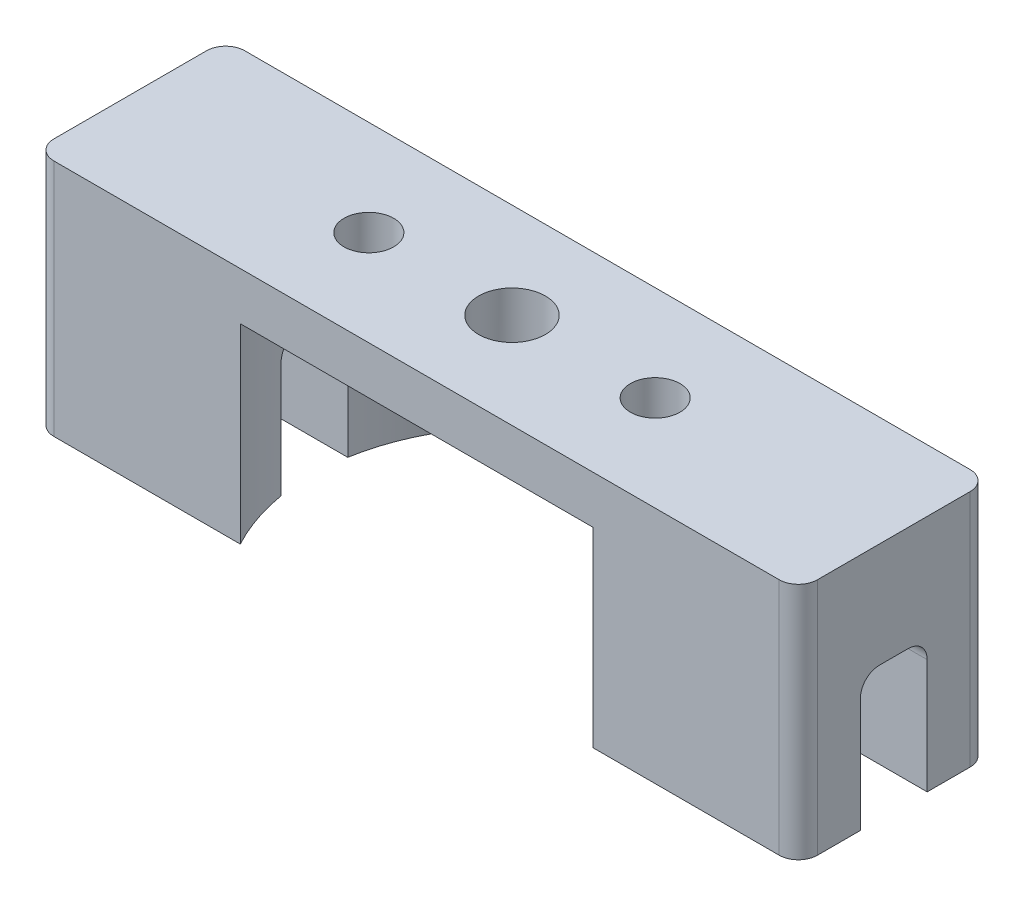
ISO-10303-21;
HEADER;
FILE_DESCRIPTION(('STEP AP214'),'2;1');
FILE_NAME('part.step','',(''),(''),'','','');
FILE_SCHEMA(('AUTOMOTIVE_DESIGN { 1 0 10303 214 1 1 1 1 }'));
ENDSEC;
DATA;
#1=APPLICATION_CONTEXT('core data for automotive mechanical design processes');
#2=APPLICATION_PROTOCOL_DEFINITION('international standard','automotive_design',2000,#1);
#3=PRODUCT_CONTEXT('',#1,'mechanical');
#4=PRODUCT('Part','Part','',(#3));
#5=PRODUCT_RELATED_PRODUCT_CATEGORY('part','',(#4));
#6=PRODUCT_DEFINITION_FORMATION('','',#4);
#7=PRODUCT_DEFINITION_CONTEXT('part definition',#1,'design');
#8=PRODUCT_DEFINITION('design','',#6,#7);
#9=PRODUCT_DEFINITION_SHAPE('','',#8);
#10=(LENGTH_UNIT() NAMED_UNIT(*) SI_UNIT(.MILLI.,.METRE.));
#11=(NAMED_UNIT(*) PLANE_ANGLE_UNIT() SI_UNIT($,.RADIAN.));
#12=(NAMED_UNIT(*) SI_UNIT($,.STERADIAN.) SOLID_ANGLE_UNIT());
#13=UNCERTAINTY_MEASURE_WITH_UNIT(LENGTH_MEASURE(1.E-05),#10,'distance_accuracy_value','');
#14=(GEOMETRIC_REPRESENTATION_CONTEXT(3) GLOBAL_UNCERTAINTY_ASSIGNED_CONTEXT((#13)) GLOBAL_UNIT_ASSIGNED_CONTEXT((#10,
#11,#12)) REPRESENTATION_CONTEXT('',''));
#15=CARTESIAN_POINT('',(0.,0.,0.));
#16=DIRECTION('',(0.,0.,1.));
#17=DIRECTION('',(1.,0.,0.));
#18=AXIS2_PLACEMENT_3D('',#15,#16,#17);
#19=CARTESIAN_POINT('',(0.,0.,0.));
#20=DIRECTION('',(0.,-1.,0.));
#21=DIRECTION('',(0.,0.,-1.));
#22=AXIS2_PLACEMENT_3D('',#19,#20,#21);
#23=PLANE('',#22);
#24=DIRECTION('',(0.,0.,-1.));
#25=VECTOR('',#24,1.);
#26=CARTESIAN_POINT('',(101.6,0.,0.));
#27=LINE('',#26,#25);
#28=CARTESIAN_POINT('',(101.6,0.,-2.54));
#29=VERTEX_POINT('',#28);
#30=CARTESIAN_POINT('',(101.6,0.,-8.255));
#31=VERTEX_POINT('',#30);
#32=EDGE_CURVE('E287',#29,#31,#27,.T.);
#33=ORIENTED_EDGE('',*,*,#32,.F.);
#34=CARTESIAN_POINT('',(99.06,0.,-2.54));
#35=DIRECTION('',(0.,-1.,0.));
#36=DIRECTION('',(0.,0.,-1.));
#37=AXIS2_PLACEMENT_3D('',#34,#35,#36);
#38=CIRCLE('',#37,2.54);
#39=CARTESIAN_POINT('',(99.06,0.,0.));
#40=VERTEX_POINT('',#39);
#41=EDGE_CURVE('E403',#29,#40,#38,.T.);
#42=ORIENTED_EDGE('',*,*,#41,.T.);
#43=DIRECTION('',(1.,0.,0.));
#44=VECTOR('',#43,1.);
#45=CARTESIAN_POINT('',(0.,0.,0.));
#46=LINE('',#45,#44);
#47=CARTESIAN_POINT('',(74.2520553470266,0.,0.));
#48=VERTEX_POINT('',#47);
#49=EDGE_CURVE('E283',#48,#40,#46,.T.);
#50=ORIENTED_EDGE('',*,*,#49,.F.);
#51=CARTESIAN_POINT('',(50.8,0.,-12.7));
#52=DIRECTION('',(0.,-1.,0.));
#53=DIRECTION('',(0.,0.,-1.));
#54=AXIS2_PLACEMENT_3D('',#51,#52,#53);
#55=CIRCLE('',#54,26.67);
#56=CARTESIAN_POINT('',(77.0969746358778,0.,-8.255));
#57=VERTEX_POINT('',#56);
#58=EDGE_CURVE('E381',#57,#48,#55,.T.);
#59=ORIENTED_EDGE('',*,*,#58,.F.);
#60=DIRECTION('',(1.,0.,0.));
#61=VECTOR('',#60,1.);
#62=CARTESIAN_POINT('',(0.,0.,-8.255));
#63=LINE('',#62,#61);
#64=EDGE_CURVE('E264',#57,#31,#63,.T.);
#65=ORIENTED_EDGE('',*,*,#64,.T.);
#66=EDGE_LOOP('',(#33,#42,#50,#59,#65));
#67=FACE_BOUND('',#66,.T.);
#68=ADVANCED_FACE('F38',(#67),#23,.T.);
#69=DIRECTION('',(-1.,0.,0.));
#70=VECTOR('',#69,1.);
#71=CARTESIAN_POINT('',(0.,0.,-25.4));
#72=LINE('',#71,#70);
#73=CARTESIAN_POINT('',(99.06,0.,-25.4));
#74=VERTEX_POINT('',#73);
#75=CARTESIAN_POINT('',(74.2520553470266,0.,-25.4));
#76=VERTEX_POINT('',#75);
#77=EDGE_CURVE('E225',#74,#76,#72,.T.);
#78=ORIENTED_EDGE('',*,*,#77,.F.);
#79=CARTESIAN_POINT('',(99.06,0.,-22.86));
#80=DIRECTION('',(0.,-1.,0.));
#81=DIRECTION('',(0.,0.,-1.));
#82=AXIS2_PLACEMENT_3D('',#79,#80,#81);
#83=CIRCLE('',#82,2.54);
#84=CARTESIAN_POINT('',(101.6,0.,-22.86));
#85=VERTEX_POINT('',#84);
#86=EDGE_CURVE('E435',#74,#85,#83,.T.);
#87=ORIENTED_EDGE('',*,*,#86,.T.);
#88=CARTESIAN_POINT('',(101.6,0.,-17.145));
#89=VERTEX_POINT('',#88);
#90=EDGE_CURVE('E286',#89,#85,#27,.T.);
#91=ORIENTED_EDGE('',*,*,#90,.F.);
#92=DIRECTION('',(1.,0.,0.));
#93=VECTOR('',#92,1.);
#94=CARTESIAN_POINT('',(0.,0.,-17.145));
#95=LINE('',#94,#93);
#96=CARTESIAN_POINT('',(77.0969746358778,0.,-17.145));
#97=VERTEX_POINT('',#96);
#98=EDGE_CURVE('E252',#97,#89,#95,.T.);
#99=ORIENTED_EDGE('',*,*,#98,.F.);
#100=EDGE_CURVE('E391',#76,#97,#55,.T.);
#101=ORIENTED_EDGE('',*,*,#100,.F.);
#102=EDGE_LOOP('',(#78,#87,#91,#99,#101));
#103=FACE_BOUND('',#102,.T.);
#104=ADVANCED_FACE('F458',(#103),#23,.T.);
#105=CARTESIAN_POINT('',(0.,0.,-8.255));
#106=DIRECTION('',(0.,0.,-1.));
#107=DIRECTION('',(0.,1.,0.));
#108=AXIS2_PLACEMENT_3D('',#105,#106,#107);
#109=PLANE('',#108);
#110=DIRECTION('',(0.,-1.,0.));
#111=VECTOR('',#110,1.);
#112=CARTESIAN_POINT('',(77.0969746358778,25.4,-8.255));
#113=LINE('',#112,#111);
#114=CARTESIAN_POINT('',(77.0969746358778,15.24,-8.255));
#115=VERTEX_POINT('',#114);
#116=EDGE_CURVE('E352',#115,#57,#113,.T.);
#117=ORIENTED_EDGE('',*,*,#116,.F.);
#118=DIRECTION('',(1.,0.,0.));
#119=VECTOR('',#118,1.);
#120=CARTESIAN_POINT('',(101.6,15.24,-8.255));
#121=LINE('',#120,#119);
#122=CARTESIAN_POINT('',(101.6,15.24,-8.255));
#123=VERTEX_POINT('',#122);
#124=EDGE_CURVE('E302',#115,#123,#121,.T.);
#125=ORIENTED_EDGE('',*,*,#124,.T.);
#126=DIRECTION('',(0.,1.,0.));
#127=VECTOR('',#126,1.);
#128=CARTESIAN_POINT('',(101.6,0.,-8.255));
#129=LINE('',#128,#127);
#130=EDGE_CURVE('E246',#31,#123,#129,.T.);
#131=ORIENTED_EDGE('',*,*,#130,.F.);
#132=ORIENTED_EDGE('',*,*,#64,.F.);
#133=EDGE_LOOP('',(#117,#125,#131,#132));
#134=FACE_BOUND('',#133,.T.);
#135=ADVANCED_FACE('F393',(#134),#109,.T.);
#136=CARTESIAN_POINT('',(0.,17.78,0.));
#137=DIRECTION('',(0.,-1.,0.));
#138=DIRECTION('',(0.,0.,-1.));
#139=AXIS2_PLACEMENT_3D('',#136,#137,#138);
#140=PLANE('',#139);
#141=CARTESIAN_POINT('',(50.8,17.78,-12.7));
#142=DIRECTION('',(0.,-1.,0.));
#143=DIRECTION('',(0.,0.,-1.));
#144=AXIS2_PLACEMENT_3D('',#141,#142,#143);
#145=CIRCLE('',#144,26.67);
#146=CARTESIAN_POINT('',(77.4018772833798,17.78,-14.605));
#147=VERTEX_POINT('',#146);
#148=CARTESIAN_POINT('',(77.4018772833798,17.78,-10.795));
#149=VERTEX_POINT('',#148);
#150=EDGE_CURVE('E219',#147,#149,#145,.T.);
#151=ORIENTED_EDGE('',*,*,#150,.F.);
#152=DIRECTION('',(1.,0.,0.));
#153=VECTOR('',#152,1.);
#154=CARTESIAN_POINT('',(0.,17.78,-14.605));
#155=LINE('',#154,#153);
#156=CARTESIAN_POINT('',(101.6,17.78,-14.605));
#157=VERTEX_POINT('',#156);
#158=EDGE_CURVE('E294',#147,#157,#155,.T.);
#159=ORIENTED_EDGE('',*,*,#158,.T.);
#160=DIRECTION('',(0.,0.,-1.));
#161=VECTOR('',#160,1.);
#162=CARTESIAN_POINT('',(101.6,17.78,0.));
#163=LINE('',#162,#161);
#164=CARTESIAN_POINT('',(101.6,17.78,-10.795));
#165=VERTEX_POINT('',#164);
#166=EDGE_CURVE('E255',#165,#157,#163,.T.);
#167=ORIENTED_EDGE('',*,*,#166,.F.);
#168=DIRECTION('',(1.,0.,0.));
#169=VECTOR('',#168,1.);
#170=CARTESIAN_POINT('',(0.,17.78,-10.795));
#171=LINE('',#170,#169);
#172=EDGE_CURVE('E291',#165,#149,#171,.F.);
#173=ORIENTED_EDGE('',*,*,#172,.T.);
#174=EDGE_LOOP('',(#151,#159,#167,#173));
#175=FACE_BOUND('',#174,.T.);
#176=ADVANCED_FACE('F468',(#175),#140,.T.);
#177=CARTESIAN_POINT('',(0.,0.,-17.145));
#178=DIRECTION('',(0.,0.,-1.));
#179=DIRECTION('',(0.,1.,0.));
#180=AXIS2_PLACEMENT_3D('',#177,#178,#179);
#181=PLANE('',#180);
#182=DIRECTION('',(1.,0.,0.));
#183=VECTOR('',#182,1.);
#184=CARTESIAN_POINT('',(0.,15.24,-17.145));
#185=LINE('',#184,#183);
#186=CARTESIAN_POINT('',(101.6,15.24,-17.145));
#187=VERTEX_POINT('',#186);
#188=CARTESIAN_POINT('',(77.0969746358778,15.24,-17.145));
#189=VERTEX_POINT('',#188);
#190=EDGE_CURVE('E299',#187,#189,#185,.F.);
#191=ORIENTED_EDGE('',*,*,#190,.T.);
#192=DIRECTION('',(0.,-1.,0.));
#193=VECTOR('',#192,1.);
#194=CARTESIAN_POINT('',(77.0969746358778,25.4,-17.145));
#195=LINE('',#194,#193);
#196=EDGE_CURVE('E351',#189,#97,#195,.T.);
#197=ORIENTED_EDGE('',*,*,#196,.T.);
#198=ORIENTED_EDGE('',*,*,#98,.T.);
#199=DIRECTION('',(0.,1.,0.));
#200=VECTOR('',#199,1.);
#201=CARTESIAN_POINT('',(101.6,0.,-17.145));
#202=LINE('',#201,#200);
#203=EDGE_CURVE('E241',#89,#187,#202,.T.);
#204=ORIENTED_EDGE('',*,*,#203,.T.);
#205=EDGE_LOOP('',(#191,#197,#198,#204));
#206=FACE_BOUND('',#205,.T.);
#207=ADVANCED_FACE('F464',(#206),#181,.F.);
#208=CARTESIAN_POINT('',(0.,15.24,-14.605));
#209=DIRECTION('',(1.,0.,0.));
#210=DIRECTION('',(0.,0.,-1.));
#211=AXIS2_PLACEMENT_3D('',#208,#209,#210);
#212=CYLINDRICAL_SURFACE('',#211,2.54);
#213=ORIENTED_EDGE('',*,*,#158,.F.);
#214=CARTESIAN_POINT('',(77.4018772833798,17.78,-14.605));
#215=CARTESIAN_POINT('',(77.3967444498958,17.7800068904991,-14.6767156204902));
#216=CARTESIAN_POINT('',(77.3913163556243,17.7769627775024,-14.7484057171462));
#217=CARTESIAN_POINT('',(77.3799271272,17.7648370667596,-14.8912247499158));
#218=CARTESIAN_POINT('',(77.3739660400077,17.7557560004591,-14.9623537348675));
#219=CARTESIAN_POINT('',(77.3615733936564,17.7316325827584,-15.1034847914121));
#220=CARTESIAN_POINT('',(77.3551422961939,17.7165960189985,-15.1734878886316));
#221=CARTESIAN_POINT('',(77.3418838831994,17.6806923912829,-15.3119236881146));
#222=CARTESIAN_POINT('',(77.3350565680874,17.6598253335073,-15.3803563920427));
#223=CARTESIAN_POINT('',(77.314103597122,17.5886683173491,-15.5826207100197));
#224=CARTESIAN_POINT('',(77.2994993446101,17.5298078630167,-15.7135036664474));
#225=CARTESIAN_POINT('',(77.2698881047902,17.3909980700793,-15.9634058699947));
#226=CARTESIAN_POINT('',(77.2548811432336,17.3110500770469,-16.0824258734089));
#227=CARTESIAN_POINT('',(77.2253534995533,17.1318765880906,-16.3058775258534));
#228=CARTESIAN_POINT('',(77.2108351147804,17.0325718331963,-16.4102460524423));
#229=CARTESIAN_POINT('',(77.1833610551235,16.817626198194,-16.6008281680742));
#230=CARTESIAN_POINT('',(77.1704056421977,16.7019825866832,-16.6870387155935));
#231=CARTESIAN_POINT('',(77.1470521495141,16.4579552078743,-16.838553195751));
#232=CARTESIAN_POINT('',(77.136646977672,16.3296081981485,-16.9039152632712));
#233=CARTESIAN_POINT('',(77.1191580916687,16.0635619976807,-17.0120575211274));
#234=CARTESIAN_POINT('',(77.1120719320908,15.9258697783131,-17.0548543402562));
#235=CARTESIAN_POINT('',(77.1036431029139,15.6960330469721,-17.1054118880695));
#236=CARTESIAN_POINT('',(77.1011501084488,15.6054246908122,-17.1202459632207));
#237=CARTESIAN_POINT('',(77.0978131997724,15.4232249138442,-17.1400395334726));
#238=CARTESIAN_POINT('',(77.0969671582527,15.331634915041,-17.1450117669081));
#239=CARTESIAN_POINT('',(77.0969746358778,15.24,-17.145));
#240=B_SPLINE_CURVE_WITH_KNOTS('',3,(#214,#215,#216,#217,#218,#219,#220,#221,#222,#223,#224,
#225,#226,#227,#228,#229,#230,#231,#232,#233,#234,#235,#236,#237,#238,#239),.UNSPECIFIED.,.F.,
.F.,(4,2,2,2,2,2,2,2,2,2,2,2,4),(0.,0.215624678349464,0.431230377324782,0.646627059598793,
0.862023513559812,1.29255953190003,1.72306808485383,2.15537791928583,2.58776010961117,
3.01892586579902,3.44977344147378,3.72480802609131,3.99948712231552),.UNSPECIFIED.);
#241=EDGE_CURVE('E343',#147,#189,#240,.T.);
#242=ORIENTED_EDGE('',*,*,#241,.T.);
#243=ORIENTED_EDGE('',*,*,#190,.F.);
#244=CARTESIAN_POINT('',(101.6,15.24,-14.605));
#245=DIRECTION('',(-1.,0.,0.));
#246=DIRECTION('',(0.,0.,1.));
#247=AXIS2_PLACEMENT_3D('',#244,#245,#246);
#248=CIRCLE('',#247,2.54);
#249=EDGE_CURVE('E306',#157,#187,#248,.T.);
#250=ORIENTED_EDGE('',*,*,#249,.F.);
#251=EDGE_LOOP('',(#213,#242,#243,#250));
#252=FACE_BOUND('',#251,.T.);
#253=ADVANCED_FACE('F361',(#252),#212,.F.);
#254=CARTESIAN_POINT('',(0.,15.24,-10.795));
#255=DIRECTION('',(-1.,0.,0.));
#256=DIRECTION('',(0.,0.,1.));
#257=AXIS2_PLACEMENT_3D('',#254,#255,#256);
#258=CYLINDRICAL_SURFACE('',#257,2.54);
#259=CARTESIAN_POINT('',(24.1981227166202,17.78,-10.795));
#260=VERTEX_POINT('',#259);
#261=CARTESIAN_POINT('',(0.,17.78,-10.795));
#262=VERTEX_POINT('',#261);
#263=EDGE_CURVE('E280',#260,#262,#171,.F.);
#264=ORIENTED_EDGE('',*,*,#263,.F.);
#265=CARTESIAN_POINT('',(24.1981227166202,17.78,-10.795));
#266=CARTESIAN_POINT('',(24.2032555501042,17.7800068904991,-10.7232843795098));
#267=CARTESIAN_POINT('',(24.2086836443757,17.7769627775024,-10.6515942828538));
#268=CARTESIAN_POINT('',(24.2200728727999,17.7648370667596,-10.5087752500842));
#269=CARTESIAN_POINT('',(24.2260339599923,17.7557560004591,-10.4376462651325));
#270=CARTESIAN_POINT('',(24.2384266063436,17.7316325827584,-10.2965152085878));
#271=CARTESIAN_POINT('',(24.2448577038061,17.7165960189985,-10.2265121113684));
#272=CARTESIAN_POINT('',(24.2581161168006,17.6806923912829,-10.0880763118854));
#273=CARTESIAN_POINT('',(24.2649434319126,17.6598253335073,-10.0196436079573));
#274=CARTESIAN_POINT('',(24.2858964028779,17.588668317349,-9.81737928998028));
#275=CARTESIAN_POINT('',(24.3005006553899,17.5298078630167,-9.6864963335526));
#276=CARTESIAN_POINT('',(24.3301118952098,17.3909980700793,-9.43659413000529));
#277=CARTESIAN_POINT('',(24.3451188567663,17.3110500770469,-9.31757412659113));
#278=CARTESIAN_POINT('',(24.3746465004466,17.1318765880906,-9.09412247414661));
#279=CARTESIAN_POINT('',(24.3891648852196,17.0325718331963,-8.9897539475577));
#280=CARTESIAN_POINT('',(24.4166389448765,16.817626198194,-8.79917183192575));
#281=CARTESIAN_POINT('',(24.4295943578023,16.7019825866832,-8.71296128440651));
#282=CARTESIAN_POINT('',(24.4529478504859,16.4579552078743,-8.56144680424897));
#283=CARTESIAN_POINT('',(24.463353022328,16.3296081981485,-8.49608473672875));
#284=CARTESIAN_POINT('',(24.4808419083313,16.0635619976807,-8.38794247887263));
#285=CARTESIAN_POINT('',(24.4879280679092,15.9258697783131,-8.34514565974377));
#286=CARTESIAN_POINT('',(24.496356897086,15.6960330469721,-8.29458811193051));
#287=CARTESIAN_POINT('',(24.4988498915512,15.6054246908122,-8.27975403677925));
#288=CARTESIAN_POINT('',(24.5021868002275,15.4232249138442,-8.25996046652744));
#289=CARTESIAN_POINT('',(24.5030328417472,15.331634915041,-8.25498823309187));
#290=CARTESIAN_POINT('',(24.5030253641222,15.24,-8.255));
#291=B_SPLINE_CURVE_WITH_KNOTS('',3,(#265,#266,#267,#268,#269,#270,#271,#272,#273,#274,#275,
#276,#277,#278,#279,#280,#281,#282,#283,#284,#285,#286,#287,#288,#289,#290),.UNSPECIFIED.,.F.,
.F.,(4,2,2,2,2,2,2,2,2,2,2,2,4),(0.,0.215624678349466,0.431230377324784,0.646627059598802,
0.862023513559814,1.29255953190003,1.72306808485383,2.15537791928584,2.58776010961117,
3.01892586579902,3.44977344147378,3.72480802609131,3.99948712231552),.UNSPECIFIED.);
#292=CARTESIAN_POINT('',(24.5030253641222,15.24,-8.255));
#293=VERTEX_POINT('',#292);
#294=EDGE_CURVE('E210',#260,#293,#291,.T.);
#295=ORIENTED_EDGE('',*,*,#294,.T.);
#296=CARTESIAN_POINT('',(0.,15.24,-8.255));
#297=VERTEX_POINT('',#296);
#298=EDGE_CURVE('E303',#297,#293,#121,.T.);
#299=ORIENTED_EDGE('',*,*,#298,.F.);
#300=CARTESIAN_POINT('',(0.,15.24,-10.795));
#301=DIRECTION('',(1.,0.,0.));
#302=DIRECTION('',(0.,0.,-1.));
#303=AXIS2_PLACEMENT_3D('',#300,#301,#302);
#304=CIRCLE('',#303,2.54);
#305=EDGE_CURVE('E312',#262,#297,#304,.T.);
#306=ORIENTED_EDGE('',*,*,#305,.F.);
#307=EDGE_LOOP('',(#264,#295,#299,#306));
#308=FACE_BOUND('',#307,.T.);
#309=ADVANCED_FACE('F472',(#308),#258,.F.);
#310=CARTESIAN_POINT('',(0.,31.75,0.));
#311=DIRECTION('',(1.,0.,0.));
#312=DIRECTION('',(0.,0.,-1.));
#313=AXIS2_PLACEMENT_3D('',#310,#311,#312);
#314=PLANE('',#313);
#315=DIRECTION('',(0.,0.,1.));
#316=VECTOR('',#315,1.);
#317=CARTESIAN_POINT('',(0.,31.75,0.));
#318=LINE('',#317,#316);
#319=CARTESIAN_POINT('',(0.,31.75,-22.86));
#320=VERTEX_POINT('',#319);
#321=CARTESIAN_POINT('',(0.,31.75,-2.54));
#322=VERTEX_POINT('',#321);
#323=EDGE_CURVE('E268',#320,#322,#318,.T.);
#324=ORIENTED_EDGE('',*,*,#323,.F.);
#325=DIRECTION('',(0.,-1.,0.));
#326=VECTOR('',#325,1.);
#327=CARTESIAN_POINT('',(0.,31.75,-22.86));
#328=LINE('',#327,#326);
#329=CARTESIAN_POINT('',(0.,0.,-22.86));
#330=VERTEX_POINT('',#329);
#331=EDGE_CURVE('E418',#320,#330,#328,.T.);
#332=ORIENTED_EDGE('',*,*,#331,.T.);
#333=DIRECTION('',(0.,0.,1.));
#334=VECTOR('',#333,1.);
#335=CARTESIAN_POINT('',(0.,0.,0.));
#336=LINE('',#335,#334);
#337=CARTESIAN_POINT('',(0.,0.,-17.145));
#338=VERTEX_POINT('',#337);
#339=EDGE_CURVE('E281',#330,#338,#336,.T.);
#340=ORIENTED_EDGE('',*,*,#339,.T.);
#341=DIRECTION('',(0.,1.,0.));
#342=VECTOR('',#341,1.);
#343=CARTESIAN_POINT('',(0.,0.,-17.145));
#344=LINE('',#343,#342);
#345=CARTESIAN_POINT('',(0.,15.24,-17.145));
#346=VERTEX_POINT('',#345);
#347=EDGE_CURVE('E242',#338,#346,#344,.T.);
#348=ORIENTED_EDGE('',*,*,#347,.T.);
#349=CARTESIAN_POINT('',(0.,15.24,-14.605));
#350=DIRECTION('',(1.,0.,0.));
#351=DIRECTION('',(0.,0.,-1.));
#352=AXIS2_PLACEMENT_3D('',#349,#350,#351);
#353=CIRCLE('',#352,2.54);
#354=CARTESIAN_POINT('',(0.,17.78,-14.605));
#355=VERTEX_POINT('',#354);
#356=EDGE_CURVE('E308',#346,#355,#353,.T.);
#357=ORIENTED_EDGE('',*,*,#356,.T.);
#358=DIRECTION('',(0.,0.,-1.));
#359=VECTOR('',#358,1.);
#360=CARTESIAN_POINT('',(0.,17.78,0.));
#361=LINE('',#360,#359);
#362=EDGE_CURVE('E245',#262,#355,#361,.T.);
#363=ORIENTED_EDGE('',*,*,#362,.F.);
#364=ORIENTED_EDGE('',*,*,#305,.T.);
#365=DIRECTION('',(0.,1.,0.));
#366=VECTOR('',#365,1.);
#367=CARTESIAN_POINT('',(0.,0.,-8.255));
#368=LINE('',#367,#366);
#369=CARTESIAN_POINT('',(0.,0.,-8.255));
#370=VERTEX_POINT('',#369);
#371=EDGE_CURVE('E249',#370,#297,#368,.T.);
#372=ORIENTED_EDGE('',*,*,#371,.F.);
#373=CARTESIAN_POINT('',(0.,0.,-2.54));
#374=VERTEX_POINT('',#373);
#375=EDGE_CURVE('E263',#370,#374,#336,.T.);
#376=ORIENTED_EDGE('',*,*,#375,.T.);
#377=DIRECTION('',(0.,-1.,0.));
#378=VECTOR('',#377,1.);
#379=CARTESIAN_POINT('',(0.,31.75,-2.54));
#380=LINE('',#379,#378);
#381=EDGE_CURVE('E416',#374,#322,#380,.F.);
#382=ORIENTED_EDGE('',*,*,#381,.T.);
#383=EDGE_LOOP('',(#324,#332,#340,#348,#357,#363,#364,#372,#376,#382));
#384=FACE_BOUND('',#383,.T.);
#385=ADVANCED_FACE('F362',(#384),#314,.F.);
#386=CARTESIAN_POINT('',(101.6,31.75,0.));
#387=DIRECTION('',(-1.,0.,0.));
#388=DIRECTION('',(0.,0.,1.));
#389=AXIS2_PLACEMENT_3D('',#386,#387,#388);
#390=PLANE('',#389);
#391=ORIENTED_EDGE('',*,*,#90,.T.);
#392=DIRECTION('',(0.,-1.,0.));
#393=VECTOR('',#392,1.);
#394=CARTESIAN_POINT('',(101.6,31.75,-22.86));
#395=LINE('',#394,#393);
#396=CARTESIAN_POINT('',(101.6,31.75,-22.86));
#397=VERTEX_POINT('',#396);
#398=EDGE_CURVE('E443',#85,#397,#395,.F.);
#399=ORIENTED_EDGE('',*,*,#398,.T.);
#400=DIRECTION('',(0.,0.,-1.));
#401=VECTOR('',#400,1.);
#402=CARTESIAN_POINT('',(101.6,31.75,0.));
#403=LINE('',#402,#401);
#404=CARTESIAN_POINT('',(101.6,31.75,-2.54));
#405=VERTEX_POINT('',#404);
#406=EDGE_CURVE('E274',#405,#397,#403,.T.);
#407=ORIENTED_EDGE('',*,*,#406,.F.);
#408=DIRECTION('',(0.,-1.,0.));
#409=VECTOR('',#408,1.);
#410=CARTESIAN_POINT('',(101.6,31.75,-2.54));
#411=LINE('',#410,#409);
#412=EDGE_CURVE('E402',#405,#29,#411,.T.);
#413=ORIENTED_EDGE('',*,*,#412,.T.);
#414=ORIENTED_EDGE('',*,*,#32,.T.);
#415=ORIENTED_EDGE('',*,*,#130,.T.);
#416=CARTESIAN_POINT('',(101.6,15.24,-10.795));
#417=DIRECTION('',(-1.,0.,0.));
#418=DIRECTION('',(0.,0.,1.));
#419=AXIS2_PLACEMENT_3D('',#416,#417,#418);
#420=CIRCLE('',#419,2.54);
#421=EDGE_CURVE('E310',#123,#165,#420,.T.);
#422=ORIENTED_EDGE('',*,*,#421,.T.);
#423=ORIENTED_EDGE('',*,*,#166,.T.);
#424=ORIENTED_EDGE('',*,*,#249,.T.);
#425=ORIENTED_EDGE('',*,*,#203,.F.);
#426=EDGE_LOOP('',(#391,#399,#407,#413,#414,#415,#422,#423,#424,#425));
#427=FACE_BOUND('',#426,.T.);
#428=ADVANCED_FACE('F397',(#427),#390,.F.);
#429=CARTESIAN_POINT('',(2.54,0.,0.));
#430=VERTEX_POINT('',#429);
#431=CARTESIAN_POINT('',(27.3479446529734,0.,0.));
#432=VERTEX_POINT('',#431);
#433=EDGE_CURVE('E284',#430,#432,#46,.T.);
#434=ORIENTED_EDGE('',*,*,#433,.F.);
#435=CARTESIAN_POINT('',(2.54,0.,-2.54));
#436=DIRECTION('',(0.,-1.,0.));
#437=DIRECTION('',(0.,0.,-1.));
#438=AXIS2_PLACEMENT_3D('',#435,#436,#437);
#439=CIRCLE('',#438,2.54);
#440=EDGE_CURVE('E11',#430,#374,#439,.T.);
#441=ORIENTED_EDGE('',*,*,#440,.T.);
#442=ORIENTED_EDGE('',*,*,#375,.F.);
#443=CARTESIAN_POINT('',(24.5030253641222,0.,-8.255));
#444=VERTEX_POINT('',#443);
#445=EDGE_CURVE('E260',#370,#444,#63,.T.);
#446=ORIENTED_EDGE('',*,*,#445,.T.);
#447=EDGE_CURVE('E392',#432,#444,#55,.T.);
#448=ORIENTED_EDGE('',*,*,#447,.F.);
#449=EDGE_LOOP('',(#434,#441,#442,#446,#448));
#450=FACE_BOUND('',#449,.T.);
#451=ADVANCED_FACE('F484',(#450),#23,.T.);
#452=CARTESIAN_POINT('',(0.,31.75,0.));
#453=DIRECTION('',(0.,0.,-1.));
#454=DIRECTION('',(-1.,0.,0.));
#455=AXIS2_PLACEMENT_3D('',#452,#453,#454);
#456=PLANE('',#455);
#457=ORIENTED_EDGE('',*,*,#49,.T.);
#458=DIRECTION('',(0.,-1.,0.));
#459=VECTOR('',#458,1.);
#460=CARTESIAN_POINT('',(99.06,31.75,0.));
#461=LINE('',#460,#459);
#462=CARTESIAN_POINT('',(99.06,31.75,0.));
#463=VERTEX_POINT('',#462);
#464=EDGE_CURVE('E412',#40,#463,#461,.F.);
#465=ORIENTED_EDGE('',*,*,#464,.T.);
#466=DIRECTION('',(1.,0.,0.));
#467=VECTOR('',#466,1.);
#468=CARTESIAN_POINT('',(0.,31.75,0.));
#469=LINE('',#468,#467);
#470=CARTESIAN_POINT('',(2.54,31.75,0.));
#471=VERTEX_POINT('',#470);
#472=EDGE_CURVE('E271',#471,#463,#469,.T.);
#473=ORIENTED_EDGE('',*,*,#472,.F.);
#474=DIRECTION('',(0.,-1.,0.));
#475=VECTOR('',#474,1.);
#476=CARTESIAN_POINT('',(2.54,31.75,0.));
#477=LINE('',#476,#475);
#478=EDGE_CURVE('E406',#471,#430,#477,.T.);
#479=ORIENTED_EDGE('',*,*,#478,.T.);
#480=ORIENTED_EDGE('',*,*,#433,.T.);
#481=DIRECTION('',(0.,-1.,0.));
#482=VECTOR('',#481,1.);
#483=CARTESIAN_POINT('',(27.3479446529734,25.4,0.));
#484=LINE('',#483,#482);
#485=CARTESIAN_POINT('',(27.3479446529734,25.4,0.));
#486=VERTEX_POINT('',#485);
#487=EDGE_CURVE('E229',#432,#486,#484,.F.);
#488=ORIENTED_EDGE('',*,*,#487,.T.);
#489=DIRECTION('',(-1.,0.,0.));
#490=VECTOR('',#489,1.);
#491=CARTESIAN_POINT('',(0.,25.4,0.));
#492=LINE('',#491,#490);
#493=CARTESIAN_POINT('',(74.2520553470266,25.4,0.));
#494=VERTEX_POINT('',#493);
#495=EDGE_CURVE('E239',#494,#486,#492,.T.);
#496=ORIENTED_EDGE('',*,*,#495,.F.);
#497=DIRECTION('',(0.,-1.,0.));
#498=VECTOR('',#497,1.);
#499=CARTESIAN_POINT('',(74.2520553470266,25.4,0.));
#500=LINE('',#499,#498);
#501=EDGE_CURVE('E218',#494,#48,#500,.T.);
#502=ORIENTED_EDGE('',*,*,#501,.T.);
#503=EDGE_LOOP('',(#457,#465,#473,#479,#480,#488,#496,#502));
#504=FACE_BOUND('',#503,.T.);
#505=ADVANCED_FACE('F410',(#504),#456,.F.);
#506=CARTESIAN_POINT('',(0.,31.75,-25.4));
#507=DIRECTION('',(0.,0.,1.));
#508=DIRECTION('',(1.,0.,0.));
#509=AXIS2_PLACEMENT_3D('',#506,#507,#508);
#510=PLANE('',#509);
#511=DIRECTION('',(-1.,0.,0.));
#512=VECTOR('',#511,1.);
#513=CARTESIAN_POINT('',(0.,31.75,-25.4));
#514=LINE('',#513,#512);
#515=CARTESIAN_POINT('',(99.06,31.75,-25.4));
#516=VERTEX_POINT('',#515);
#517=CARTESIAN_POINT('',(2.54,31.75,-25.4));
#518=VERTEX_POINT('',#517);
#519=EDGE_CURVE('E277',#516,#518,#514,.T.);
#520=ORIENTED_EDGE('',*,*,#519,.F.);
#521=DIRECTION('',(0.,-1.,0.));
#522=VECTOR('',#521,1.);
#523=CARTESIAN_POINT('',(99.06,31.75,-25.4));
#524=LINE('',#523,#522);
#525=EDGE_CURVE('E433',#516,#74,#524,.T.);
#526=ORIENTED_EDGE('',*,*,#525,.T.);
#527=ORIENTED_EDGE('',*,*,#77,.T.);
#528=DIRECTION('',(0.,-1.,0.));
#529=VECTOR('',#528,1.);
#530=CARTESIAN_POINT('',(74.2520553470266,25.4,-25.4));
#531=LINE('',#530,#529);
#532=CARTESIAN_POINT('',(74.2520553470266,25.4,-25.4));
#533=VERTEX_POINT('',#532);
#534=EDGE_CURVE('E215',#76,#533,#531,.F.);
#535=ORIENTED_EDGE('',*,*,#534,.T.);
#536=DIRECTION('',(1.,0.,0.));
#537=VECTOR('',#536,1.);
#538=CARTESIAN_POINT('',(0.,25.4,-25.4));
#539=LINE('',#538,#537);
#540=CARTESIAN_POINT('',(27.3479446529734,25.4,-25.4));
#541=VERTEX_POINT('',#540);
#542=EDGE_CURVE('E199',#541,#533,#539,.T.);
#543=ORIENTED_EDGE('',*,*,#542,.F.);
#544=DIRECTION('',(0.,-1.,0.));
#545=VECTOR('',#544,1.);
#546=CARTESIAN_POINT('',(27.3479446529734,25.4,-25.4));
#547=LINE('',#546,#545);
#548=CARTESIAN_POINT('',(27.3479446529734,0.,-25.4));
#549=VERTEX_POINT('',#548);
#550=EDGE_CURVE('E226',#541,#549,#547,.T.);
#551=ORIENTED_EDGE('',*,*,#550,.T.);
#552=CARTESIAN_POINT('',(2.54,0.,-25.4));
#553=VERTEX_POINT('',#552);
#554=EDGE_CURVE('E289',#549,#553,#72,.T.);
#555=ORIENTED_EDGE('',*,*,#554,.T.);
#556=DIRECTION('',(0.,-1.,0.));
#557=VECTOR('',#556,1.);
#558=CARTESIAN_POINT('',(2.54,31.75,-25.4));
#559=LINE('',#558,#557);
#560=EDGE_CURVE('E209',#553,#518,#559,.F.);
#561=ORIENTED_EDGE('',*,*,#560,.T.);
#562=EDGE_LOOP('',(#520,#526,#527,#535,#543,#551,#555,#561));
#563=FACE_BOUND('',#562,.T.);
#564=ADVANCED_FACE('F222',(#563),#510,.F.);
#565=CARTESIAN_POINT('',(0.,31.75,0.));
#566=DIRECTION('',(0.,-1.,0.));
#567=DIRECTION('',(0.,0.,-1.));
#568=AXIS2_PLACEMENT_3D('',#565,#566,#567);
#569=PLANE('',#568);
#570=CARTESIAN_POINT('',(69.85,31.75,-12.7));
#571=DIRECTION('',(0.,1.,0.));
#572=DIRECTION('',(0.,0.,-1.));
#573=AXIS2_PLACEMENT_3D('',#570,#571,#572);
#574=CIRCLE('',#573,3.302);
#575=CARTESIAN_POINT('',(69.85,31.75,-16.002));
#576=VERTEX_POINT('',#575);
#577=EDGE_CURVE('E511',#576,#576,#574,.T.);
#578=ORIENTED_EDGE('',*,*,#577,.F.);
#579=EDGE_LOOP('',(#578));
#580=FACE_BOUND('',#579,.T.);
#581=CARTESIAN_POINT('',(31.75,31.75,-12.7));
#582=DIRECTION('',(0.,1.,0.));
#583=DIRECTION('',(0.,0.,1.));
#584=AXIS2_PLACEMENT_3D('',#581,#582,#583);
#585=CIRCLE('',#584,3.302);
#586=CARTESIAN_POINT('',(31.75,31.75,-9.398));
#587=VERTEX_POINT('',#586);
#588=EDGE_CURVE('E510',#587,#587,#585,.T.);
#589=ORIENTED_EDGE('',*,*,#588,.F.);
#590=EDGE_LOOP('',(#589));
#591=FACE_BOUND('',#590,.T.);
#592=CARTESIAN_POINT('',(50.8,31.75,-12.7));
#593=DIRECTION('',(0.,1.,0.));
#594=DIRECTION('',(0.,0.,1.));
#595=AXIS2_PLACEMENT_3D('',#592,#593,#594);
#596=CIRCLE('',#595,4.445);
#597=CARTESIAN_POINT('',(50.8,31.75,-8.255));
#598=VERTEX_POINT('',#597);
#599=EDGE_CURVE('E506',#598,#598,#596,.T.);
#600=ORIENTED_EDGE('',*,*,#599,.F.);
#601=EDGE_LOOP('',(#600));
#602=FACE_BOUND('',#601,.T.);
#603=ORIENTED_EDGE('',*,*,#406,.T.);
#604=CARTESIAN_POINT('',(99.06,31.75,-22.86));
#605=DIRECTION('',(0.,-1.,0.));
#606=DIRECTION('',(0.,0.,-1.));
#607=AXIS2_PLACEMENT_3D('',#604,#605,#606);
#608=CIRCLE('',#607,2.54);
#609=EDGE_CURVE('E407',#397,#516,#608,.F.);
#610=ORIENTED_EDGE('',*,*,#609,.T.);
#611=ORIENTED_EDGE('',*,*,#519,.T.);
#612=CARTESIAN_POINT('',(2.54,31.75,-22.86));
#613=DIRECTION('',(0.,-1.,0.));
#614=DIRECTION('',(0.,0.,-1.));
#615=AXIS2_PLACEMENT_3D('',#612,#613,#614);
#616=CIRCLE('',#615,2.54);
#617=EDGE_CURVE('E432',#518,#320,#616,.F.);
#618=ORIENTED_EDGE('',*,*,#617,.T.);
#619=ORIENTED_EDGE('',*,*,#323,.T.);
#620=CARTESIAN_POINT('',(2.54,31.75,-2.54));
#621=DIRECTION('',(0.,-1.,0.));
#622=DIRECTION('',(0.,0.,-1.));
#623=AXIS2_PLACEMENT_3D('',#620,#621,#622);
#624=CIRCLE('',#623,2.54);
#625=EDGE_CURVE('E445',#322,#471,#624,.F.);
#626=ORIENTED_EDGE('',*,*,#625,.T.);
#627=ORIENTED_EDGE('',*,*,#472,.T.);
#628=CARTESIAN_POINT('',(99.06,31.75,-2.54));
#629=DIRECTION('',(0.,-1.,0.));
#630=DIRECTION('',(0.,0.,-1.));
#631=AXIS2_PLACEMENT_3D('',#628,#629,#630);
#632=CIRCLE('',#631,2.54);
#633=EDGE_CURVE('E415',#463,#405,#632,.F.);
#634=ORIENTED_EDGE('',*,*,#633,.T.);
#635=EDGE_LOOP('',(#603,#610,#611,#618,#619,#626,#627,#634));
#636=FACE_BOUND('',#635,.T.);
#637=ADVANCED_FACE('F451',(#580,#591,#602,#636),#569,.F.);
#638=ORIENTED_EDGE('',*,*,#339,.F.);
#639=CARTESIAN_POINT('',(2.54,0.,-22.86));
#640=DIRECTION('',(0.,-1.,0.));
#641=DIRECTION('',(0.,0.,-1.));
#642=AXIS2_PLACEMENT_3D('',#639,#640,#641);
#643=CIRCLE('',#642,2.54);
#644=EDGE_CURVE('E46',#330,#553,#643,.T.);
#645=ORIENTED_EDGE('',*,*,#644,.T.);
#646=ORIENTED_EDGE('',*,*,#554,.F.);
#647=CARTESIAN_POINT('',(24.5030253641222,0.,-17.145));
#648=VERTEX_POINT('',#647);
#649=EDGE_CURVE('E504',#648,#549,#55,.T.);
#650=ORIENTED_EDGE('',*,*,#649,.F.);
#651=EDGE_CURVE('E265',#338,#648,#95,.T.);
#652=ORIENTED_EDGE('',*,*,#651,.F.);
#653=EDGE_LOOP('',(#638,#645,#646,#650,#652));
#654=FACE_BOUND('',#653,.T.);
#655=ADVANCED_FACE('F427',(#654),#23,.T.);
#656=DIRECTION('',(0.,-1.,0.));
#657=VECTOR('',#656,1.);
#658=CARTESIAN_POINT('',(24.5030253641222,25.4,-8.255));
#659=LINE('',#658,#657);
#660=EDGE_CURVE('E370',#444,#293,#659,.F.);
#661=ORIENTED_EDGE('',*,*,#660,.F.);
#662=ORIENTED_EDGE('',*,*,#445,.F.);
#663=ORIENTED_EDGE('',*,*,#371,.T.);
#664=ORIENTED_EDGE('',*,*,#298,.T.);
#665=EDGE_LOOP('',(#661,#662,#663,#664));
#666=FACE_BOUND('',#665,.T.);
#667=ADVANCED_FACE('F337',(#666),#109,.T.);
#668=CARTESIAN_POINT('',(24.1981227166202,17.78,-14.605));
#669=VERTEX_POINT('',#668);
#670=EDGE_CURVE('E371',#260,#669,#145,.T.);
#671=ORIENTED_EDGE('',*,*,#670,.F.);
#672=ORIENTED_EDGE('',*,*,#263,.T.);
#673=ORIENTED_EDGE('',*,*,#362,.T.);
#674=EDGE_CURVE('E295',#355,#669,#155,.T.);
#675=ORIENTED_EDGE('',*,*,#674,.T.);
#676=EDGE_LOOP('',(#671,#672,#673,#675));
#677=FACE_BOUND('',#676,.T.);
#678=ADVANCED_FACE('F492',(#677),#140,.T.);
#679=ORIENTED_EDGE('',*,*,#651,.T.);
#680=DIRECTION('',(0.,-1.,0.));
#681=VECTOR('',#680,1.);
#682=CARTESIAN_POINT('',(24.5030253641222,25.4,-17.145));
#683=LINE('',#682,#681);
#684=CARTESIAN_POINT('',(24.5030253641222,15.24,-17.145));
#685=VERTEX_POINT('',#684);
#686=EDGE_CURVE('E227',#648,#685,#683,.F.);
#687=ORIENTED_EDGE('',*,*,#686,.T.);
#688=EDGE_CURVE('E298',#685,#346,#185,.F.);
#689=ORIENTED_EDGE('',*,*,#688,.T.);
#690=ORIENTED_EDGE('',*,*,#347,.F.);
#691=EDGE_LOOP('',(#679,#687,#689,#690));
#692=FACE_BOUND('',#691,.T.);
#693=ADVANCED_FACE('F359',(#692),#181,.F.);
#694=ORIENTED_EDGE('',*,*,#688,.F.);
#695=CARTESIAN_POINT('',(24.5030253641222,15.24,-17.145));
#696=CARTESIAN_POINT('',(24.5030287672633,15.3108336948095,-17.1450074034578));
#697=CARTESIAN_POINT('',(24.5025245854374,15.3816636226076,-17.1420370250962));
#698=CARTESIAN_POINT('',(24.5005263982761,15.5228085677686,-17.1301979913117));
#699=CARTESIAN_POINT('',(24.4990324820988,15.5931236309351,-17.1213298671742));
#700=CARTESIAN_POINT('',(24.4950826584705,15.7326562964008,-17.0977674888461));
#701=CARTESIAN_POINT('',(24.4926279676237,15.8018751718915,-17.0830806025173));
#702=CARTESIAN_POINT('',(24.4868086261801,15.9387943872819,-17.048007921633));
#703=CARTESIAN_POINT('',(24.4834439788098,16.0064947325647,-17.0276221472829));
#704=CARTESIAN_POINT('',(24.472074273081,16.2066412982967,-16.9581059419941));
#705=CARTESIAN_POINT('',(24.4627909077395,16.3362191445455,-16.9006019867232));
#706=CARTESIAN_POINT('',(24.4415286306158,16.5837894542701,-16.7650414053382));
#707=CARTESIAN_POINT('',(24.4295497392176,16.7017820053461,-16.6869849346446));
#708=CARTESIAN_POINT('',(24.403660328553,16.9239728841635,-16.5118278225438));
#709=CARTESIAN_POINT('',(24.3897353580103,17.0280554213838,-16.4145822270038));
#710=CARTESIAN_POINT('',(24.3609925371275,17.2185042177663,-16.2041460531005));
#711=CARTESIAN_POINT('',(24.3461744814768,17.3048663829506,-16.090951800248));
#712=CARTESIAN_POINT('',(24.3164551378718,17.4583153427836,-15.8504867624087));
#713=CARTESIAN_POINT('',(24.3015546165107,17.525189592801,-15.7230803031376));
#714=CARTESIAN_POINT('',(24.2727345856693,17.6365060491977,-15.4587528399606));
#715=CARTESIAN_POINT('',(24.2588144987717,17.6809615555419,-15.3218375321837));
#716=CARTESIAN_POINT('',(24.2369233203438,17.7356123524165,-15.0876517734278));
#717=CARTESIAN_POINT('',(24.2284839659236,17.7522374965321,-14.9918761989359));
#718=CARTESIAN_POINT('',(24.2125565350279,17.7744319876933,-14.7990946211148));
#719=CARTESIAN_POINT('',(24.2050673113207,17.7800147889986,-14.7020902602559));
#720=CARTESIAN_POINT('',(24.1981227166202,17.78,-14.605));
#721=B_SPLINE_CURVE_WITH_KNOTS('',3,(#695,#696,#697,#698,#699,#700,#701,#702,#703,#704,#705,
#706,#707,#708,#709,#710,#711,#712,#713,#714,#715,#716,#717,#718,#719,#720),.UNSPECIFIED.,.F.,
.F.,(4,2,2,2,2,2,2,2,2,2,2,2,4),(0.,0.212430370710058,0.424841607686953,0.636984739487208,
0.849127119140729,1.27315307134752,1.69717581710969,2.12453350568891,2.55198981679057,
2.98394722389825,3.41564806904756,3.70776877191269,3.99953332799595),.UNSPECIFIED.);
#722=EDGE_CURVE('E232',#685,#669,#721,.T.);
#723=ORIENTED_EDGE('',*,*,#722,.T.);
#724=ORIENTED_EDGE('',*,*,#674,.F.);
#725=ORIENTED_EDGE('',*,*,#356,.F.);
#726=EDGE_LOOP('',(#694,#723,#724,#725));
#727=FACE_BOUND('',#726,.T.);
#728=ADVANCED_FACE('F355',(#727),#212,.F.);
#729=ORIENTED_EDGE('',*,*,#124,.F.);
#730=CARTESIAN_POINT('',(77.0969746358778,15.24,-8.255));
#731=CARTESIAN_POINT('',(77.0969712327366,15.3108336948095,-8.25499259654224));
#732=CARTESIAN_POINT('',(77.0974754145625,15.3816636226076,-8.25796297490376));
#733=CARTESIAN_POINT('',(77.0994736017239,15.5228085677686,-8.26980200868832));
#734=CARTESIAN_POINT('',(77.1009675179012,15.5931236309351,-8.27867013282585));
#735=CARTESIAN_POINT('',(77.1049173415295,15.7326562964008,-8.30223251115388));
#736=CARTESIAN_POINT('',(77.1073720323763,15.8018751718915,-8.31691939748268));
#737=CARTESIAN_POINT('',(77.1131913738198,15.9387943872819,-8.35199207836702));
#738=CARTESIAN_POINT('',(77.1165560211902,16.0064947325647,-8.37237785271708));
#739=CARTESIAN_POINT('',(77.127925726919,16.2066412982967,-8.44189405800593));
#740=CARTESIAN_POINT('',(77.1372090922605,16.3362191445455,-8.49939801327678));
#741=CARTESIAN_POINT('',(77.1584713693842,16.5837894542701,-8.63495859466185));
#742=CARTESIAN_POINT('',(77.1704502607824,16.7017820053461,-8.71301506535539));
#743=CARTESIAN_POINT('',(77.1963396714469,16.9239728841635,-8.88817217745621));
#744=CARTESIAN_POINT('',(77.2102646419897,17.0280554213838,-8.98541777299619));
#745=CARTESIAN_POINT('',(77.2390074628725,17.2185042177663,-9.19585394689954));
#746=CARTESIAN_POINT('',(77.2538255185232,17.3048663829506,-9.30904819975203));
#747=CARTESIAN_POINT('',(77.2835448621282,17.4583153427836,-9.54951323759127));
#748=CARTESIAN_POINT('',(77.2984453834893,17.525189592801,-9.67691969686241));
#749=CARTESIAN_POINT('',(77.3272654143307,17.6365060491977,-9.94124716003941));
#750=CARTESIAN_POINT('',(77.3411855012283,17.6809615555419,-10.0781624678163));
#751=CARTESIAN_POINT('',(77.3630766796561,17.7356123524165,-10.3123482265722));
#752=CARTESIAN_POINT('',(77.3715160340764,17.7522374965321,-10.4081238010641));
#753=CARTESIAN_POINT('',(77.3874434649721,17.7744319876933,-10.6009053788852));
#754=CARTESIAN_POINT('',(77.3949326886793,17.7800147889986,-10.6979097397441));
#755=CARTESIAN_POINT('',(77.4018772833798,17.78,-10.795));
#756=B_SPLINE_CURVE_WITH_KNOTS('',3,(#730,#731,#732,#733,#734,#735,#736,#737,#738,#739,#740,
#741,#742,#743,#744,#745,#746,#747,#748,#749,#750,#751,#752,#753,#754,#755),.UNSPECIFIED.,.F.,
.F.,(4,2,2,2,2,2,2,2,2,2,2,2,4),(0.,0.212430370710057,0.424841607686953,0.636984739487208,
0.849127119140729,1.27315307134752,1.69717581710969,2.12453350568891,2.55198981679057,
2.98394722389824,3.41564806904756,3.70776877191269,3.99953332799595),.UNSPECIFIED.);
#757=EDGE_CURVE('E314',#115,#149,#756,.T.);
#758=ORIENTED_EDGE('',*,*,#757,.T.);
#759=ORIENTED_EDGE('',*,*,#172,.F.);
#760=ORIENTED_EDGE('',*,*,#421,.F.);
#761=EDGE_LOOP('',(#729,#758,#759,#760));
#762=FACE_BOUND('',#761,.T.);
#763=ADVANCED_FACE('F327',(#762),#258,.F.);
#764=CARTESIAN_POINT('',(50.8,25.4,-12.7));
#765=DIRECTION('',(0.,-1.,0.));
#766=DIRECTION('',(0.,0.,-1.));
#767=AXIS2_PLACEMENT_3D('',#764,#765,#766);
#768=PLANE('',#767);
#769=CARTESIAN_POINT('',(69.85,25.4,-12.7));
#770=DIRECTION('',(0.,-1.,0.));
#771=DIRECTION('',(0.,0.,-1.));
#772=AXIS2_PLACEMENT_3D('',#769,#770,#771);
#773=CIRCLE('',#772,3.302);
#774=CARTESIAN_POINT('',(69.85,25.4,-16.002));
#775=VERTEX_POINT('',#774);
#776=EDGE_CURVE('E438',#775,#775,#773,.T.);
#777=ORIENTED_EDGE('',*,*,#776,.F.);
#778=EDGE_LOOP('',(#777));
#779=FACE_BOUND('',#778,.T.);
#780=CARTESIAN_POINT('',(31.75,25.4,-12.7));
#781=DIRECTION('',(0.,-1.,0.));
#782=DIRECTION('',(0.,0.,-1.));
#783=AXIS2_PLACEMENT_3D('',#780,#781,#782);
#784=CIRCLE('',#783,3.302);
#785=CARTESIAN_POINT('',(31.75,25.4,-16.002));
#786=VERTEX_POINT('',#785);
#787=EDGE_CURVE('E543',#786,#786,#784,.T.);
#788=ORIENTED_EDGE('',*,*,#787,.F.);
#789=EDGE_LOOP('',(#788));
#790=FACE_BOUND('',#789,.T.);
#791=CARTESIAN_POINT('',(50.8,25.4,-12.7));
#792=DIRECTION('',(0.,-1.,0.));
#793=DIRECTION('',(0.,0.,-1.));
#794=AXIS2_PLACEMENT_3D('',#791,#792,#793);
#795=CIRCLE('',#794,4.445);
#796=CARTESIAN_POINT('',(50.8,25.4,-17.145));
#797=VERTEX_POINT('',#796);
#798=EDGE_CURVE('E509',#797,#797,#795,.T.);
#799=ORIENTED_EDGE('',*,*,#798,.F.);
#800=EDGE_LOOP('',(#799));
#801=FACE_BOUND('',#800,.T.);
#802=ORIENTED_EDGE('',*,*,#495,.T.);
#803=CARTESIAN_POINT('',(50.8,25.4,-12.7));
#804=DIRECTION('',(0.,-1.,0.));
#805=DIRECTION('',(0.,0.,-1.));
#806=AXIS2_PLACEMENT_3D('',#803,#804,#805);
#807=CIRCLE('',#806,26.67);
#808=EDGE_CURVE('E205',#486,#541,#807,.T.);
#809=ORIENTED_EDGE('',*,*,#808,.T.);
#810=ORIENTED_EDGE('',*,*,#542,.T.);
#811=EDGE_CURVE('E202',#533,#494,#807,.T.);
#812=ORIENTED_EDGE('',*,*,#811,.T.);
#813=EDGE_LOOP('',(#802,#809,#810,#812));
#814=FACE_BOUND('',#813,.T.);
#815=ADVANCED_FACE('F201',(#779,#790,#801,#814),#768,.T.);
#816=CARTESIAN_POINT('',(50.8,25.4,-12.7));
#817=DIRECTION('',(0.,-1.,0.));
#818=DIRECTION('',(0.,0.,-1.));
#819=AXIS2_PLACEMENT_3D('',#816,#817,#818);
#820=CYLINDRICAL_SURFACE('',#819,26.67);
#821=ORIENTED_EDGE('',*,*,#811,.F.);
#822=ORIENTED_EDGE('',*,*,#534,.F.);
#823=ORIENTED_EDGE('',*,*,#100,.T.);
#824=ORIENTED_EDGE('',*,*,#196,.F.);
#825=ORIENTED_EDGE('',*,*,#241,.F.);
#826=ORIENTED_EDGE('',*,*,#150,.T.);
#827=ORIENTED_EDGE('',*,*,#757,.F.);
#828=ORIENTED_EDGE('',*,*,#116,.T.);
#829=ORIENTED_EDGE('',*,*,#58,.T.);
#830=ORIENTED_EDGE('',*,*,#501,.F.);
#831=EDGE_LOOP('',(#821,#822,#823,#824,#825,#826,#827,#828,#829,#830));
#832=FACE_BOUND('',#831,.T.);
#833=ADVANCED_FACE('F214',(#832),#820,.F.);
#834=ORIENTED_EDGE('',*,*,#447,.T.);
#835=ORIENTED_EDGE('',*,*,#660,.T.);
#836=ORIENTED_EDGE('',*,*,#294,.F.);
#837=ORIENTED_EDGE('',*,*,#670,.T.);
#838=ORIENTED_EDGE('',*,*,#722,.F.);
#839=ORIENTED_EDGE('',*,*,#686,.F.);
#840=ORIENTED_EDGE('',*,*,#649,.T.);
#841=ORIENTED_EDGE('',*,*,#550,.F.);
#842=ORIENTED_EDGE('',*,*,#808,.F.);
#843=ORIENTED_EDGE('',*,*,#487,.F.);
#844=EDGE_LOOP('',(#834,#835,#836,#837,#838,#839,#840,#841,#842,#843));
#845=FACE_BOUND('',#844,.T.);
#846=ADVANCED_FACE('F335',(#845),#820,.F.);
#847=CARTESIAN_POINT('',(50.8,0.,-12.7));
#848=DIRECTION('',(0.,1.,0.));
#849=DIRECTION('',(0.,0.,1.));
#850=AXIS2_PLACEMENT_3D('',#847,#848,#849);
#851=CYLINDRICAL_SURFACE('',#850,4.445);
#852=ORIENTED_EDGE('',*,*,#798,.T.);
#853=EDGE_LOOP('',(#852));
#854=FACE_BOUND('',#853,.T.);
#855=ORIENTED_EDGE('',*,*,#599,.T.);
#856=EDGE_LOOP('',(#855));
#857=FACE_BOUND('',#856,.T.);
#858=ADVANCED_FACE('F522',(#854,#857),#851,.F.);
#859=CARTESIAN_POINT('',(31.75,0.,-12.7));
#860=DIRECTION('',(0.,1.,0.));
#861=DIRECTION('',(0.,0.,1.));
#862=AXIS2_PLACEMENT_3D('',#859,#860,#861);
#863=CYLINDRICAL_SURFACE('',#862,3.302);
#864=ORIENTED_EDGE('',*,*,#787,.T.);
#865=EDGE_LOOP('',(#864));
#866=FACE_BOUND('',#865,.T.);
#867=ORIENTED_EDGE('',*,*,#588,.T.);
#868=EDGE_LOOP('',(#867));
#869=FACE_BOUND('',#868,.T.);
#870=ADVANCED_FACE('F517',(#866,#869),#863,.F.);
#871=CARTESIAN_POINT('',(69.85,0.,-12.7));
#872=DIRECTION('',(0.,1.,0.));
#873=DIRECTION('',(0.,0.,1.));
#874=AXIS2_PLACEMENT_3D('',#871,#872,#873);
#875=CYLINDRICAL_SURFACE('',#874,3.302);
#876=ORIENTED_EDGE('',*,*,#776,.T.);
#877=EDGE_LOOP('',(#876));
#878=FACE_BOUND('',#877,.T.);
#879=ORIENTED_EDGE('',*,*,#577,.T.);
#880=EDGE_LOOP('',(#879));
#881=FACE_BOUND('',#880,.T.);
#882=ADVANCED_FACE('F529',(#878,#881),#875,.F.);
#883=CARTESIAN_POINT('',(99.06,31.75,-22.86));
#884=DIRECTION('',(0.,-1.,0.));
#885=DIRECTION('',(0.,0.,-1.));
#886=AXIS2_PLACEMENT_3D('',#883,#884,#885);
#887=CYLINDRICAL_SURFACE('',#886,2.54);
#888=ORIENTED_EDGE('',*,*,#609,.F.);
#889=ORIENTED_EDGE('',*,*,#398,.F.);
#890=ORIENTED_EDGE('',*,*,#86,.F.);
#891=ORIENTED_EDGE('',*,*,#525,.F.);
#892=EDGE_LOOP('',(#888,#889,#890,#891));
#893=FACE_BOUND('',#892,.T.);
#894=ADVANCED_FACE('F455',(#893),#887,.T.);
#895=CARTESIAN_POINT('',(99.06,31.75,-2.54));
#896=DIRECTION('',(0.,-1.,0.));
#897=DIRECTION('',(0.,0.,-1.));
#898=AXIS2_PLACEMENT_3D('',#895,#896,#897);
#899=CYLINDRICAL_SURFACE('',#898,2.54);
#900=ORIENTED_EDGE('',*,*,#633,.F.);
#901=ORIENTED_EDGE('',*,*,#464,.F.);
#902=ORIENTED_EDGE('',*,*,#41,.F.);
#903=ORIENTED_EDGE('',*,*,#412,.F.);
#904=EDGE_LOOP('',(#900,#901,#902,#903));
#905=FACE_BOUND('',#904,.T.);
#906=ADVANCED_FACE('F414',(#905),#899,.T.);
#907=CARTESIAN_POINT('',(2.54,31.75,-22.86));
#908=DIRECTION('',(0.,-1.,0.));
#909=DIRECTION('',(0.,0.,-1.));
#910=AXIS2_PLACEMENT_3D('',#907,#908,#909);
#911=CYLINDRICAL_SURFACE('',#910,2.54);
#912=ORIENTED_EDGE('',*,*,#617,.F.);
#913=ORIENTED_EDGE('',*,*,#560,.F.);
#914=ORIENTED_EDGE('',*,*,#644,.F.);
#915=ORIENTED_EDGE('',*,*,#331,.F.);
#916=EDGE_LOOP('',(#912,#913,#914,#915));
#917=FACE_BOUND('',#916,.T.);
#918=ADVANCED_FACE('F431',(#917),#911,.T.);
#919=CARTESIAN_POINT('',(2.54,31.75,-2.54));
#920=DIRECTION('',(0.,-1.,0.));
#921=DIRECTION('',(0.,0.,-1.));
#922=AXIS2_PLACEMENT_3D('',#919,#920,#921);
#923=CYLINDRICAL_SURFACE('',#922,2.54);
#924=ORIENTED_EDGE('',*,*,#625,.F.);
#925=ORIENTED_EDGE('',*,*,#381,.F.);
#926=ORIENTED_EDGE('',*,*,#440,.F.);
#927=ORIENTED_EDGE('',*,*,#478,.F.);
#928=EDGE_LOOP('',(#924,#925,#926,#927));
#929=FACE_BOUND('',#928,.T.);
#930=ADVANCED_FACE('F40',(#929),#923,.T.);
#931=CLOSED_SHELL('',(#68,#104,#135,#176,#207,#253,#309,#385,#428,#451,#505,#564,#637,#655,#667,
#678,#693,#728,#763,#815,#833,#846,#858,#870,#882,#894,#906,#918,#930));
#932=MANIFOLD_SOLID_BREP('B2',#931);
#933=ADVANCED_BREP_SHAPE_REPRESENTATION('',(#18,#932),#14);
#934=SHAPE_DEFINITION_REPRESENTATION(#9,#933);
ENDSEC;
END-ISO-10303-21;
